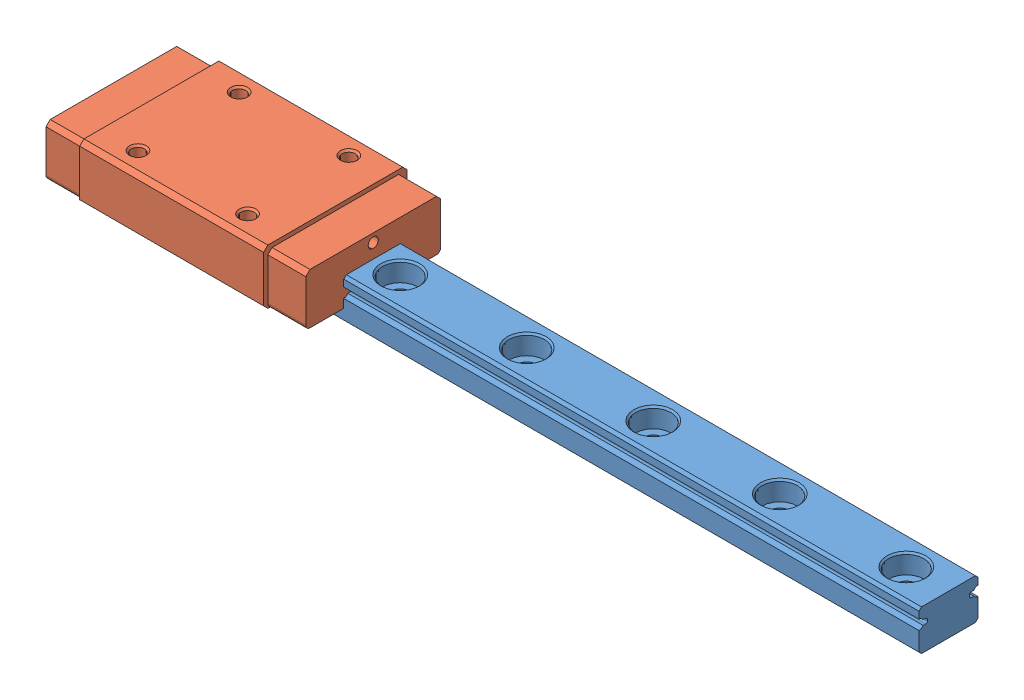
SolidWorks assembly MLN7H.stp.sldasm, configuration 默认 (file format 13000). Lengths in mm.
Overall size (100 8 17).
2 component instances, 2 part files, 0 mates.
Components (placement in the parent):
- MLNR7R100-E=5-1: MLNR7R100-E=5.SLDPRT [默认] at origin size (100 4.8 7)
- MLN7H-1: MLN7H.SLDPRT [默认] at (1 1.5 0) size (30.8 6.5 17)
